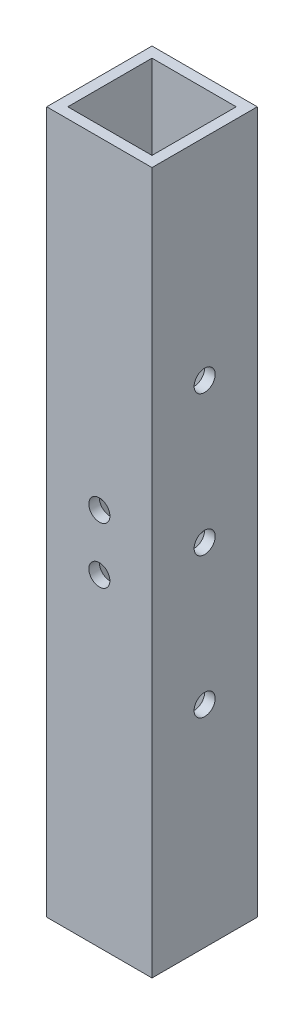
from build123d import *

# Parameters (mm, degrees)
SKETCH_1_W            = 15
SKETCH_1_H            = 15
SKETCH_1_W_2          = 12
SKETCH_1_H_2          = 12
EXTRUDE_1_DEPTH       = 100
CUT_EXTRUDE_1_REACH   = 104.225
SKETCH_2_R            = 1.5
HOLE_WIZARD_3_0_3_1_D = 3
HOLE_WIZARD_3_0_3_2_D = 3


with BuildPart() as part:
    # Sketch 1 → Extrude 1 (new body)
    with BuildSketch(Plane(origin=(0, 0, 0), x_dir=(1, 0, 0), z_dir=(0, 1, 0))):
        with Locations((7.5, 7.5)):
            Rectangle(SKETCH_1_W, SKETCH_1_H)
        with Locations((7.5, 7.5)):
            Rectangle(SKETCH_1_W_2, SKETCH_1_H_2, mode=Mode.SUBTRACT)
    extrude(amount=EXTRUDE_1_DEPTH)

    # Cut-Extrude 1: up to this face of the body (flat: up to its plane)
    cut_extrude_1_end = Plane(part.part.faces().sort_by_distance((7.5, 50, -15))[0])
    # Sketch 2 → Cut-Extrude 1 (cut, up to the picked face)
    with BuildSketch(Plane.XY, mode=Mode.PRIVATE) as cut_extrude_1_sk1:
        with Locations((7.5, 54)):
            Circle(SKETCH_2_R)
    cut_extrude_1_tool1 = split(extrude(cut_extrude_1_sk1.sketch, amount=-CUT_EXTRUDE_1_REACH, mode=Mode.PRIVATE), bisect_by=cut_extrude_1_end, keep=Keep.BOTH, mode=Mode.PRIVATE)
    # Sketch 2 → Cut-Extrude 1 (cut, up to the picked face)
    with BuildSketch(Plane.XY, mode=Mode.PRIVATE) as cut_extrude_1_sk2:
        with Locations((7.5, 46)):
            Circle(SKETCH_2_R)
    cut_extrude_1_tool2 = split(extrude(cut_extrude_1_sk2.sketch, amount=-CUT_EXTRUDE_1_REACH, mode=Mode.PRIVATE), bisect_by=cut_extrude_1_end, keep=Keep.BOTH, mode=Mode.PRIVATE)
    add(cut_extrude_1_tool1.solids().sort_by(Axis((7.5, 54, 0), (0, 0, -1)))[0], mode=Mode.SUBTRACT)
    add(cut_extrude_1_tool2.solids().sort_by(Axis((7.5, 46, 0), (0, 0, -1)))[0], mode=Mode.SUBTRACT)

    # Hole Wizard 3.0 _3_ _1 (through all)
    with Locations(Plane(origin=(15, 0, 0), x_dir=(0, 0, -1), z_dir=(1, 0, 0))):
        with Locations((7.5, 70), (7.5, 30)):
            Hole(HOLE_WIZARD_3_0_3_1_D / 2)

    # Hole Wizard 3.0 _3_ _2 (through all)
    with Locations(Plane(origin=(15, 0, 0), x_dir=(0, 0, -1), z_dir=(1, 0, 0))):
        with Locations((7.5, 50)):
            Hole(HOLE_WIZARD_3_0_3_2_D / 2)


solid = part.part
